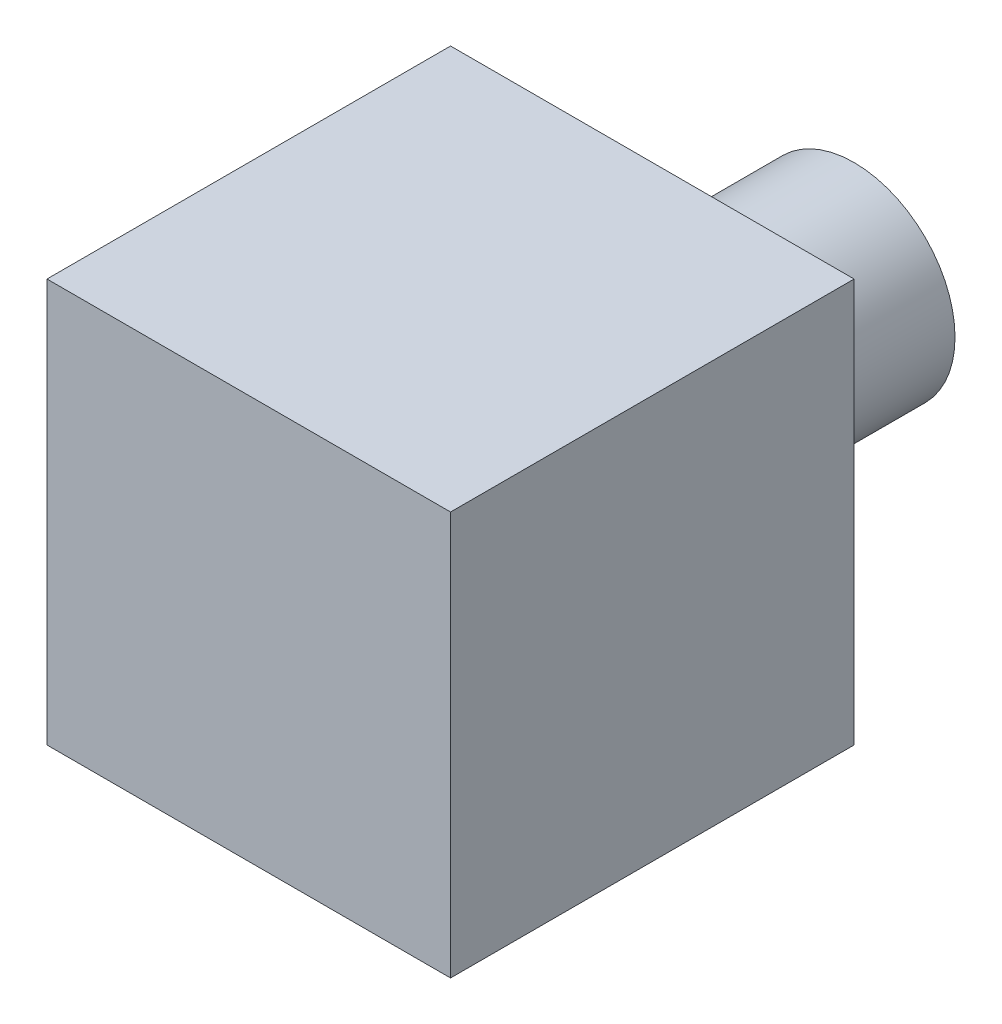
ISO-10303-21;
HEADER;
FILE_DESCRIPTION(('STEP AP214'),'2;1');
FILE_NAME('part.step','',(''),(''),'','','');
FILE_SCHEMA(('AUTOMOTIVE_DESIGN { 1 0 10303 214 1 1 1 1 }'));
ENDSEC;
DATA;
#1=APPLICATION_CONTEXT('core data for automotive mechanical design processes');
#2=APPLICATION_PROTOCOL_DEFINITION('international standard','automotive_design',2000,#1);
#3=PRODUCT_CONTEXT('',#1,'mechanical');
#4=PRODUCT('Part','Part','',(#3));
#5=PRODUCT_RELATED_PRODUCT_CATEGORY('part','',(#4));
#6=PRODUCT_DEFINITION_FORMATION('','',#4);
#7=PRODUCT_DEFINITION_CONTEXT('part definition',#1,'design');
#8=PRODUCT_DEFINITION('design','',#6,#7);
#9=PRODUCT_DEFINITION_SHAPE('','',#8);
#10=(LENGTH_UNIT() NAMED_UNIT(*) SI_UNIT(.MILLI.,.METRE.));
#11=(NAMED_UNIT(*) PLANE_ANGLE_UNIT() SI_UNIT($,.RADIAN.));
#12=(NAMED_UNIT(*) SI_UNIT($,.STERADIAN.) SOLID_ANGLE_UNIT());
#13=UNCERTAINTY_MEASURE_WITH_UNIT(LENGTH_MEASURE(1.E-05),#10,'distance_accuracy_value','');
#14=(GEOMETRIC_REPRESENTATION_CONTEXT(3) GLOBAL_UNCERTAINTY_ASSIGNED_CONTEXT((#13)) GLOBAL_UNIT_ASSIGNED_CONTEXT((#10,
#11,#12)) REPRESENTATION_CONTEXT('',''));
#15=CARTESIAN_POINT('',(0.,0.,0.));
#16=DIRECTION('',(0.,0.,1.));
#17=DIRECTION('',(1.,0.,0.));
#18=AXIS2_PLACEMENT_3D('',#15,#16,#17);
#19=CARTESIAN_POINT('',(0.,0.,0.));
#20=DIRECTION('',(0.,0.,1.));
#21=DIRECTION('',(1.,0.,0.));
#22=AXIS2_PLACEMENT_3D('',#19,#20,#21);
#23=PLANE('',#22);
#24=DIRECTION('',(0.,-1.,0.));
#25=VECTOR('',#24,1.);
#26=CARTESIAN_POINT('',(-10.,10.,0.));
#27=LINE('',#26,#25);
#28=CARTESIAN_POINT('',(-10.,10.,0.));
#29=VERTEX_POINT('',#28);
#30=CARTESIAN_POINT('',(-10.,-10.,0.));
#31=VERTEX_POINT('',#30);
#32=EDGE_CURVE('E100',#29,#31,#27,.T.);
#33=ORIENTED_EDGE('',*,*,#32,.F.);
#34=DIRECTION('',(-1.,0.,0.));
#35=VECTOR('',#34,1.);
#36=CARTESIAN_POINT('',(-10.,10.,0.));
#37=LINE('',#36,#35);
#38=CARTESIAN_POINT('',(10.,10.,0.));
#39=VERTEX_POINT('',#38);
#40=EDGE_CURVE('E73',#39,#29,#37,.T.);
#41=ORIENTED_EDGE('',*,*,#40,.F.);
#42=DIRECTION('',(0.,1.,0.));
#43=VECTOR('',#42,1.);
#44=CARTESIAN_POINT('',(10.,10.,0.));
#45=LINE('',#44,#43);
#46=CARTESIAN_POINT('',(10.,-10.,0.));
#47=VERTEX_POINT('',#46);
#48=EDGE_CURVE('E67',#47,#39,#45,.T.);
#49=ORIENTED_EDGE('',*,*,#48,.F.);
#50=DIRECTION('',(1.,0.,0.));
#51=VECTOR('',#50,1.);
#52=CARTESIAN_POINT('',(-10.,-10.,0.));
#53=LINE('',#52,#51);
#54=EDGE_CURVE('E91',#31,#47,#53,.T.);
#55=ORIENTED_EDGE('',*,*,#54,.F.);
#56=EDGE_LOOP('',(#33,#41,#49,#55));
#57=FACE_BOUND('',#56,.T.);
#58=CARTESIAN_POINT('',(0.,0.,0.));
#59=DIRECTION('',(0.,0.,1.));
#60=DIRECTION('',(1.,0.,0.));
#61=AXIS2_PLACEMENT_3D('',#58,#59,#60);
#62=CIRCLE('',#61,5.);
#63=CARTESIAN_POINT('',(5.,0.,0.));
#64=VERTEX_POINT('',#63);
#65=EDGE_CURVE('E11',#64,#64,#62,.F.);
#66=ORIENTED_EDGE('',*,*,#65,.F.);
#67=EDGE_LOOP('',(#66));
#68=FACE_BOUND('',#67,.T.);
#69=ADVANCED_FACE('F33',(#57,#68),#23,.F.);
#70=CARTESIAN_POINT('',(-10.,10.,20.));
#71=DIRECTION('',(1.,0.,0.));
#72=DIRECTION('',(0.,1.,0.));
#73=AXIS2_PLACEMENT_3D('',#70,#71,#72);
#74=PLANE('',#73);
#75=ORIENTED_EDGE('',*,*,#32,.T.);
#76=DIRECTION('',(0.,0.,-1.));
#77=VECTOR('',#76,1.);
#78=CARTESIAN_POINT('',(-10.,-10.,20.));
#79=LINE('',#78,#77);
#80=CARTESIAN_POINT('',(-10.,-10.,20.));
#81=VERTEX_POINT('',#80);
#82=EDGE_CURVE('E42',#81,#31,#79,.T.);
#83=ORIENTED_EDGE('',*,*,#82,.F.);
#84=DIRECTION('',(0.,-1.,0.));
#85=VECTOR('',#84,1.);
#86=CARTESIAN_POINT('',(-10.,10.,20.));
#87=LINE('',#86,#85);
#88=CARTESIAN_POINT('',(-10.,10.,20.));
#89=VERTEX_POINT('',#88);
#90=EDGE_CURVE('E86',#89,#81,#87,.T.);
#91=ORIENTED_EDGE('',*,*,#90,.F.);
#92=DIRECTION('',(0.,0.,-1.));
#93=VECTOR('',#92,1.);
#94=CARTESIAN_POINT('',(-10.,10.,20.));
#95=LINE('',#94,#93);
#96=EDGE_CURVE('E96',#89,#29,#95,.T.);
#97=ORIENTED_EDGE('',*,*,#96,.T.);
#98=EDGE_LOOP('',(#75,#83,#91,#97));
#99=FACE_BOUND('',#98,.T.);
#100=ADVANCED_FACE('F35',(#99),#74,.F.);
#101=CARTESIAN_POINT('',(-10.,-10.,20.));
#102=DIRECTION('',(0.,1.,0.));
#103=DIRECTION('',(-1.,0.,0.));
#104=AXIS2_PLACEMENT_3D('',#101,#102,#103);
#105=PLANE('',#104);
#106=ORIENTED_EDGE('',*,*,#54,.T.);
#107=DIRECTION('',(0.,0.,-1.));
#108=VECTOR('',#107,1.);
#109=CARTESIAN_POINT('',(10.,-10.,20.));
#110=LINE('',#109,#108);
#111=CARTESIAN_POINT('',(10.,-10.,20.));
#112=VERTEX_POINT('',#111);
#113=EDGE_CURVE('E89',#112,#47,#110,.T.);
#114=ORIENTED_EDGE('',*,*,#113,.F.);
#115=DIRECTION('',(1.,0.,0.));
#116=VECTOR('',#115,1.);
#117=CARTESIAN_POINT('',(-10.,-10.,20.));
#118=LINE('',#117,#116);
#119=EDGE_CURVE('E81',#81,#112,#118,.T.);
#120=ORIENTED_EDGE('',*,*,#119,.F.);
#121=ORIENTED_EDGE('',*,*,#82,.T.);
#122=EDGE_LOOP('',(#106,#114,#120,#121));
#123=FACE_BOUND('',#122,.T.);
#124=ADVANCED_FACE('F90',(#123),#105,.F.);
#125=CARTESIAN_POINT('',(10.,10.,20.));
#126=DIRECTION('',(-1.,0.,0.));
#127=DIRECTION('',(0.,-1.,0.));
#128=AXIS2_PLACEMENT_3D('',#125,#126,#127);
#129=PLANE('',#128);
#130=ORIENTED_EDGE('',*,*,#48,.T.);
#131=DIRECTION('',(0.,0.,-1.));
#132=VECTOR('',#131,1.);
#133=CARTESIAN_POINT('',(10.,10.,20.));
#134=LINE('',#133,#132);
#135=CARTESIAN_POINT('',(10.,10.,20.));
#136=VERTEX_POINT('',#135);
#137=EDGE_CURVE('E92',#136,#39,#134,.T.);
#138=ORIENTED_EDGE('',*,*,#137,.F.);
#139=DIRECTION('',(0.,1.,0.));
#140=VECTOR('',#139,1.);
#141=CARTESIAN_POINT('',(10.,10.,20.));
#142=LINE('',#141,#140);
#143=EDGE_CURVE('E84',#112,#136,#142,.T.);
#144=ORIENTED_EDGE('',*,*,#143,.F.);
#145=ORIENTED_EDGE('',*,*,#113,.T.);
#146=EDGE_LOOP('',(#130,#138,#144,#145));
#147=FACE_BOUND('',#146,.T.);
#148=ADVANCED_FACE('F94',(#147),#129,.F.);
#149=CARTESIAN_POINT('',(-10.,10.,20.));
#150=DIRECTION('',(0.,-1.,0.));
#151=DIRECTION('',(1.,0.,0.));
#152=AXIS2_PLACEMENT_3D('',#149,#150,#151);
#153=PLANE('',#152);
#154=ORIENTED_EDGE('',*,*,#40,.T.);
#155=ORIENTED_EDGE('',*,*,#96,.F.);
#156=DIRECTION('',(-1.,0.,0.));
#157=VECTOR('',#156,1.);
#158=CARTESIAN_POINT('',(-10.,10.,20.));
#159=LINE('',#158,#157);
#160=EDGE_CURVE('E50',#136,#89,#159,.T.);
#161=ORIENTED_EDGE('',*,*,#160,.F.);
#162=ORIENTED_EDGE('',*,*,#137,.T.);
#163=EDGE_LOOP('',(#154,#155,#161,#162));
#164=FACE_BOUND('',#163,.T.);
#165=ADVANCED_FACE('F128',(#164),#153,.F.);
#166=CARTESIAN_POINT('',(0.,0.,20.));
#167=DIRECTION('',(0.,0.,1.));
#168=DIRECTION('',(1.,0.,0.));
#169=AXIS2_PLACEMENT_3D('',#166,#167,#168);
#170=PLANE('',#169);
#171=ORIENTED_EDGE('',*,*,#90,.T.);
#172=ORIENTED_EDGE('',*,*,#119,.T.);
#173=ORIENTED_EDGE('',*,*,#143,.T.);
#174=ORIENTED_EDGE('',*,*,#160,.T.);
#175=EDGE_LOOP('',(#171,#172,#173,#174));
#176=FACE_BOUND('',#175,.T.);
#177=ADVANCED_FACE('F82',(#176),#170,.T.);
#178=CARTESIAN_POINT('',(0.,0.,-10.));
#179=DIRECTION('',(0.,0.,1.));
#180=DIRECTION('',(1.,0.,0.));
#181=AXIS2_PLACEMENT_3D('',#178,#179,#180);
#182=CYLINDRICAL_SURFACE('',#181,5.);
#183=CARTESIAN_POINT('',(0.,0.,-10.));
#184=DIRECTION('',(0.,0.,-1.));
#185=DIRECTION('',(-1.,0.,0.));
#186=AXIS2_PLACEMENT_3D('',#183,#184,#185);
#187=CIRCLE('',#186,5.);
#188=CARTESIAN_POINT('',(-5.,0.,-10.));
#189=VERTEX_POINT('',#188);
#190=EDGE_CURVE('E103',#189,#189,#187,.T.);
#191=ORIENTED_EDGE('',*,*,#190,.F.);
#192=EDGE_LOOP('',(#191));
#193=FACE_BOUND('',#192,.T.);
#194=ORIENTED_EDGE('',*,*,#65,.T.);
#195=EDGE_LOOP('',(#194));
#196=FACE_BOUND('',#195,.T.);
#197=ADVANCED_FACE('F116',(#193,#196),#182,.T.);
#198=CARTESIAN_POINT('',(0.,0.,-10.));
#199=DIRECTION('',(0.,0.,-1.));
#200=DIRECTION('',(-1.,0.,0.));
#201=AXIS2_PLACEMENT_3D('',#198,#199,#200);
#202=PLANE('',#201);
#203=ORIENTED_EDGE('',*,*,#190,.T.);
#204=EDGE_LOOP('',(#203));
#205=FACE_BOUND('',#204,.T.);
#206=ADVANCED_FACE('F118',(#205),#202,.T.);
#207=CLOSED_SHELL('',(#69,#100,#124,#148,#165,#177,#197,#206));
#208=MANIFOLD_SOLID_BREP('B2',#207);
#209=ADVANCED_BREP_SHAPE_REPRESENTATION('',(#18,#208),#14);
#210=SHAPE_DEFINITION_REPRESENTATION(#9,#209);
ENDSEC;
END-ISO-10303-21;
